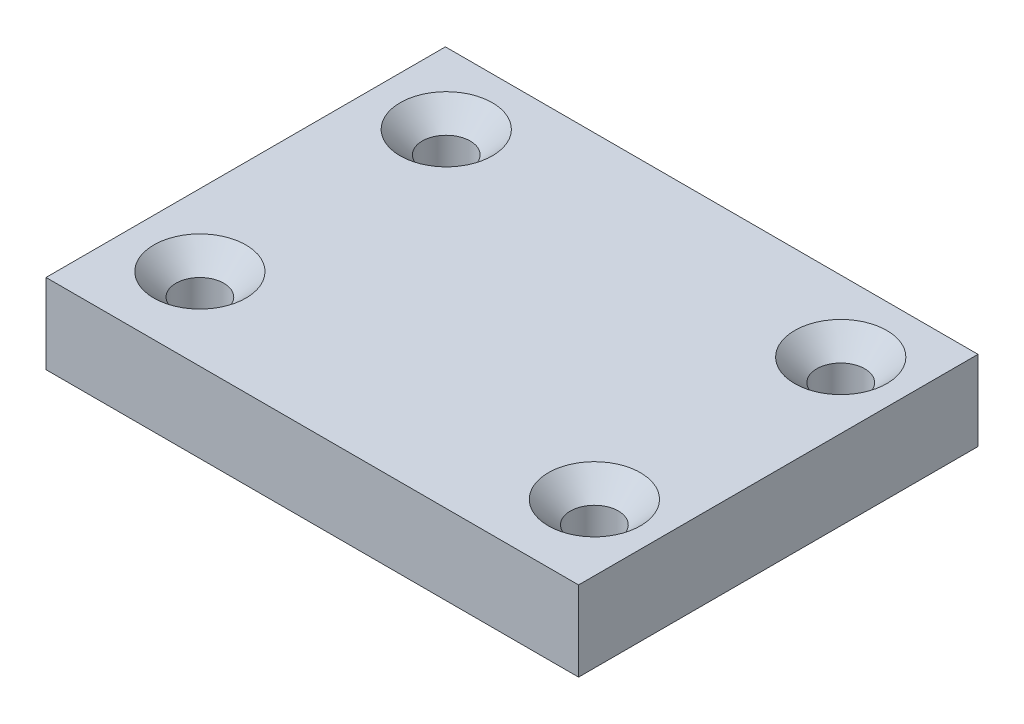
from build123d import *

# Parameters (mm, degrees)
SKETCH1_W                                       = 100
SKETCH1_H                                       = 75
EXTRUDE1_DEPTH                                  = 15
CSK_FOR_M8_FLAT_HEAD_MACHINE_SCREW3_D           = 9
CSK_FOR_M8_FLAT_HEAD_MACHINE_SCREW3_CSINK_D     = 17.3
CSK_FOR_M8_FLAT_HEAD_MACHINE_SCREW3_CSINK_ANGLE = 90


with BuildPart() as part:
    # Sketch1 → Extrude1 (new body)
    with BuildSketch(Plane(origin=(0, 0, 0), x_dir=(1, 0, 0), z_dir=(0, 1, 0))):
        Rectangle(SKETCH1_W, SKETCH1_H)
    extrude(amount=EXTRUDE1_DEPTH)

    # CSK for M8 Flat Head Machine Screw3 (through all)
    with Locations(Plane(origin=(0, 15, 0), x_dir=(-1, 0, 0), z_dir=(0, 1, 0))):
        with Locations((36.516436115, 22.088353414), (36.516436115, -24.170757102), (-37.557637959, -24.170757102), (-37.557637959, 22.088353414)):
            CounterSinkHole(CSK_FOR_M8_FLAT_HEAD_MACHINE_SCREW3_D / 2, CSK_FOR_M8_FLAT_HEAD_MACHINE_SCREW3_CSINK_D / 2, counter_sink_angle=CSK_FOR_M8_FLAT_HEAD_MACHINE_SCREW3_CSINK_ANGLE)


solid = part.part
